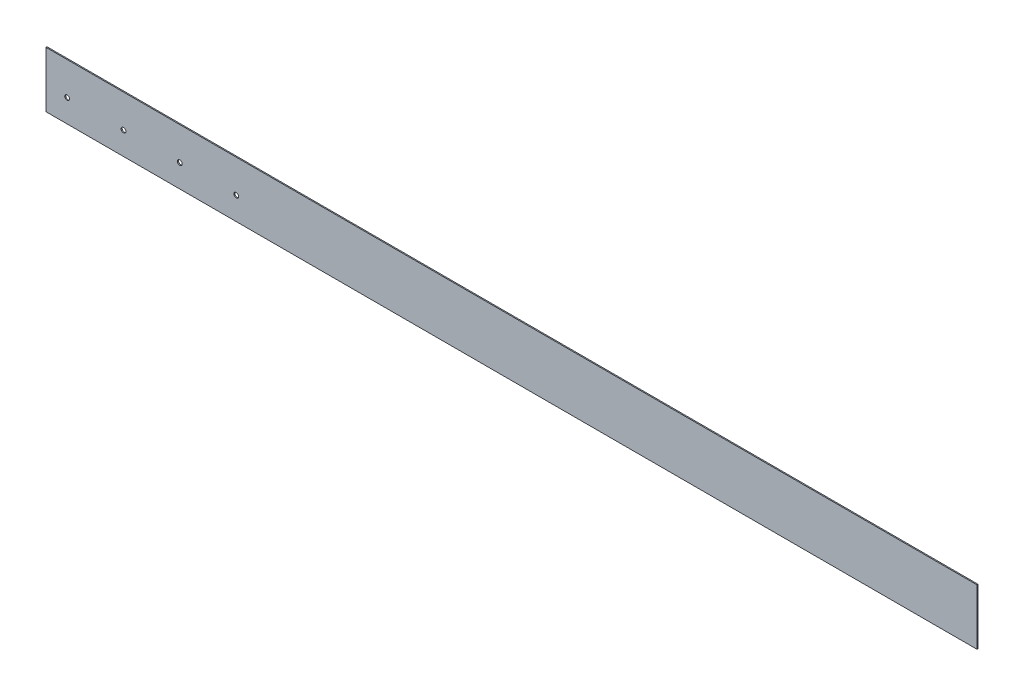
ISO-10303-21;
HEADER;
FILE_DESCRIPTION(('STEP AP214'),'2;1');
FILE_NAME('part.step','',(''),(''),'','','');
FILE_SCHEMA(('AUTOMOTIVE_DESIGN { 1 0 10303 214 1 1 1 1 }'));
ENDSEC;
DATA;
#1=APPLICATION_CONTEXT('core data for automotive mechanical design processes');
#2=APPLICATION_PROTOCOL_DEFINITION('international standard','automotive_design',2000,#1);
#3=PRODUCT_CONTEXT('',#1,'mechanical');
#4=PRODUCT('Part','Part','',(#3));
#5=PRODUCT_RELATED_PRODUCT_CATEGORY('part','',(#4));
#6=PRODUCT_DEFINITION_FORMATION('','',#4);
#7=PRODUCT_DEFINITION_CONTEXT('part definition',#1,'design');
#8=PRODUCT_DEFINITION('design','',#6,#7);
#9=PRODUCT_DEFINITION_SHAPE('','',#8);
#10=(LENGTH_UNIT() NAMED_UNIT(*) SI_UNIT(.MILLI.,.METRE.));
#11=(NAMED_UNIT(*) PLANE_ANGLE_UNIT() SI_UNIT($,.RADIAN.));
#12=(NAMED_UNIT(*) SI_UNIT($,.STERADIAN.) SOLID_ANGLE_UNIT());
#13=UNCERTAINTY_MEASURE_WITH_UNIT(LENGTH_MEASURE(1.E-05),#10,'distance_accuracy_value','');
#14=(GEOMETRIC_REPRESENTATION_CONTEXT(3) GLOBAL_UNCERTAINTY_ASSIGNED_CONTEXT((#13)) GLOBAL_UNIT_ASSIGNED_CONTEXT((#10,
#11,#12)) REPRESENTATION_CONTEXT('',''));
#15=CARTESIAN_POINT('',(0.,0.,0.));
#16=DIRECTION('',(0.,0.,1.));
#17=DIRECTION('',(1.,0.,0.));
#18=AXIS2_PLACEMENT_3D('',#15,#16,#17);
#19=CARTESIAN_POINT('',(0.,0.,10.));
#20=DIRECTION('',(1.,0.,0.));
#21=DIRECTION('',(0.,0.,-1.));
#22=AXIS2_PLACEMENT_3D('',#19,#20,#21);
#23=PLANE('',#22);
#24=DIRECTION('',(0.,-1.,0.));
#25=VECTOR('',#24,1.);
#26=CARTESIAN_POINT('',(0.,0.,0.));
#27=LINE('',#26,#25);
#28=CARTESIAN_POINT('',(0.,528.535100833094,0.));
#29=VERTEX_POINT('',#28);
#30=CARTESIAN_POINT('',(0.,0.,0.));
#31=VERTEX_POINT('',#30);
#32=EDGE_CURVE('E93',#29,#31,#27,.T.);
#33=ORIENTED_EDGE('',*,*,#32,.T.);
#34=DIRECTION('',(0.,0.,-1.));
#35=VECTOR('',#34,1.);
#36=CARTESIAN_POINT('',(0.,0.,10.));
#37=LINE('',#36,#35);
#38=CARTESIAN_POINT('',(0.,0.,10.));
#39=VERTEX_POINT('',#38);
#40=EDGE_CURVE('E11',#39,#31,#37,.T.);
#41=ORIENTED_EDGE('',*,*,#40,.F.);
#42=DIRECTION('',(0.,-1.,0.));
#43=VECTOR('',#42,1.);
#44=CARTESIAN_POINT('',(0.,0.,10.));
#45=LINE('',#44,#43);
#46=CARTESIAN_POINT('',(0.,528.535100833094,10.));
#47=VERTEX_POINT('',#46);
#48=EDGE_CURVE('E81',#47,#39,#45,.T.);
#49=ORIENTED_EDGE('',*,*,#48,.F.);
#50=DIRECTION('',(0.,0.,-1.));
#51=VECTOR('',#50,1.);
#52=CARTESIAN_POINT('',(0.,528.535100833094,10.));
#53=LINE('',#52,#51);
#54=EDGE_CURVE('E89',#47,#29,#53,.T.);
#55=ORIENTED_EDGE('',*,*,#54,.T.);
#56=EDGE_LOOP('',(#33,#41,#49,#55));
#57=FACE_BOUND('',#56,.T.);
#58=ADVANCED_FACE('F30',(#57),#23,.F.);
#59=CARTESIAN_POINT('',(0.,0.,10.));
#60=DIRECTION('',(0.,1.,0.));
#61=DIRECTION('',(0.,0.,1.));
#62=AXIS2_PLACEMENT_3D('',#59,#60,#61);
#63=PLANE('',#62);
#64=DIRECTION('',(1.,0.,0.));
#65=VECTOR('',#64,1.);
#66=CARTESIAN_POINT('',(0.,0.,0.));
#67=LINE('',#66,#65);
#68=CARTESIAN_POINT('',(8816.6546434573,0.,0.));
#69=VERTEX_POINT('',#68);
#70=EDGE_CURVE('E85',#31,#69,#67,.T.);
#71=ORIENTED_EDGE('',*,*,#70,.T.);
#72=DIRECTION('',(0.,0.,-1.));
#73=VECTOR('',#72,1.);
#74=CARTESIAN_POINT('',(8816.6546434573,0.,10.));
#75=LINE('',#74,#73);
#76=CARTESIAN_POINT('',(8816.6546434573,0.,10.));
#77=VERTEX_POINT('',#76);
#78=EDGE_CURVE('E38',#77,#69,#75,.T.);
#79=ORIENTED_EDGE('',*,*,#78,.F.);
#80=DIRECTION('',(1.,0.,0.));
#81=VECTOR('',#80,1.);
#82=CARTESIAN_POINT('',(0.,0.,10.));
#83=LINE('',#82,#81);
#84=EDGE_CURVE('E76',#39,#77,#83,.T.);
#85=ORIENTED_EDGE('',*,*,#84,.F.);
#86=ORIENTED_EDGE('',*,*,#40,.T.);
#87=EDGE_LOOP('',(#71,#79,#85,#86));
#88=FACE_BOUND('',#87,.T.);
#89=ADVANCED_FACE('F84',(#88),#63,.F.);
#90=CARTESIAN_POINT('',(8816.6546434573,0.,10.));
#91=DIRECTION('',(-1.,0.,0.));
#92=DIRECTION('',(0.,0.,1.));
#93=AXIS2_PLACEMENT_3D('',#90,#91,#92);
#94=PLANE('',#93);
#95=DIRECTION('',(0.,1.,0.));
#96=VECTOR('',#95,1.);
#97=CARTESIAN_POINT('',(8816.6546434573,0.,0.));
#98=LINE('',#97,#96);
#99=CARTESIAN_POINT('',(8816.6546434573,528.535100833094,0.));
#100=VERTEX_POINT('',#99);
#101=EDGE_CURVE('E63',#69,#100,#98,.T.);
#102=ORIENTED_EDGE('',*,*,#101,.T.);
#103=DIRECTION('',(0.,0.,-1.));
#104=VECTOR('',#103,1.);
#105=CARTESIAN_POINT('',(8816.6546434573,528.535100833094,10.));
#106=LINE('',#105,#104);
#107=CARTESIAN_POINT('',(8816.6546434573,528.535100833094,10.));
#108=VERTEX_POINT('',#107);
#109=EDGE_CURVE('E86',#108,#100,#106,.T.);
#110=ORIENTED_EDGE('',*,*,#109,.F.);
#111=DIRECTION('',(0.,1.,0.));
#112=VECTOR('',#111,1.);
#113=CARTESIAN_POINT('',(8816.6546434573,0.,10.));
#114=LINE('',#113,#112);
#115=EDGE_CURVE('E79',#77,#108,#114,.T.);
#116=ORIENTED_EDGE('',*,*,#115,.F.);
#117=ORIENTED_EDGE('',*,*,#78,.T.);
#118=EDGE_LOOP('',(#102,#110,#116,#117));
#119=FACE_BOUND('',#118,.T.);
#120=ADVANCED_FACE('F87',(#119),#94,.F.);
#121=CARTESIAN_POINT('',(0.,528.535100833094,10.));
#122=DIRECTION('',(0.,-1.,0.));
#123=DIRECTION('',(0.,0.,-1.));
#124=AXIS2_PLACEMENT_3D('',#121,#122,#123);
#125=PLANE('',#124);
#126=DIRECTION('',(-1.,0.,0.));
#127=VECTOR('',#126,1.);
#128=CARTESIAN_POINT('',(0.,528.535100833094,0.));
#129=LINE('',#128,#127);
#130=EDGE_CURVE('E69',#100,#29,#129,.T.);
#131=ORIENTED_EDGE('',*,*,#130,.T.);
#132=ORIENTED_EDGE('',*,*,#54,.F.);
#133=DIRECTION('',(-1.,0.,0.));
#134=VECTOR('',#133,1.);
#135=CARTESIAN_POINT('',(0.,528.535100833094,10.));
#136=LINE('',#135,#134);
#137=EDGE_CURVE('E46',#108,#47,#136,.T.);
#138=ORIENTED_EDGE('',*,*,#137,.F.);
#139=ORIENTED_EDGE('',*,*,#109,.T.);
#140=EDGE_LOOP('',(#131,#132,#138,#139));
#141=FACE_BOUND('',#140,.T.);
#142=ADVANCED_FACE('F101',(#141),#125,.F.);
#143=CARTESIAN_POINT('',(0.,528.535100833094,10.));
#144=DIRECTION('',(0.,0.,-1.));
#145=DIRECTION('',(-1.,0.,0.));
#146=AXIS2_PLACEMENT_3D('',#143,#144,#145);
#147=PLANE('',#146);
#148=CARTESIAN_POINT('',(1801.45218186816,216.299758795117,10.));
#149=DIRECTION('',(0.,0.,1.));
#150=DIRECTION('',(1.,0.,0.));
#151=AXIS2_PLACEMENT_3D('',#148,#149,#150);
#152=CIRCLE('',#151,22.5);
#153=CARTESIAN_POINT('',(1823.95218186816,216.299758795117,10.));
#154=VERTEX_POINT('',#153);
#155=EDGE_CURVE('E124',#154,#154,#152,.T.);
#156=ORIENTED_EDGE('',*,*,#155,.F.);
#157=EDGE_LOOP('',(#156));
#158=FACE_BOUND('',#157,.T.);
#159=CARTESIAN_POINT('',(1267.63478791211,216.299758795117,10.));
#160=DIRECTION('',(0.,0.,1.));
#161=DIRECTION('',(1.,0.,0.));
#162=AXIS2_PLACEMENT_3D('',#159,#160,#161);
#163=CIRCLE('',#162,22.5);
#164=CARTESIAN_POINT('',(1290.13478791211,216.299758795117,10.));
#165=VERTEX_POINT('',#164);
#166=EDGE_CURVE('E118',#165,#165,#163,.T.);
#167=ORIENTED_EDGE('',*,*,#166,.F.);
#168=EDGE_LOOP('',(#167));
#169=FACE_BOUND('',#168,.T.);
#170=CARTESIAN_POINT('',(733.817393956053,216.299758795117,10.));
#171=DIRECTION('',(0.,0.,1.));
#172=DIRECTION('',(1.,0.,0.));
#173=AXIS2_PLACEMENT_3D('',#170,#171,#172);
#174=CIRCLE('',#173,22.5);
#175=CARTESIAN_POINT('',(756.317393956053,216.299758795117,10.));
#176=VERTEX_POINT('',#175);
#177=EDGE_CURVE('E112',#176,#176,#174,.T.);
#178=ORIENTED_EDGE('',*,*,#177,.F.);
#179=EDGE_LOOP('',(#178));
#180=FACE_BOUND('',#179,.T.);
#181=CARTESIAN_POINT('',(200.,216.299758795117,10.));
#182=DIRECTION('',(0.,0.,1.));
#183=DIRECTION('',(1.,0.,0.));
#184=AXIS2_PLACEMENT_3D('',#181,#182,#183);
#185=CIRCLE('',#184,22.5);
#186=CARTESIAN_POINT('',(222.5,216.299758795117,10.));
#187=VERTEX_POINT('',#186);
#188=EDGE_CURVE('E109',#187,#187,#185,.T.);
#189=ORIENTED_EDGE('',*,*,#188,.F.);
#190=EDGE_LOOP('',(#189));
#191=FACE_BOUND('',#190,.T.);
#192=ORIENTED_EDGE('',*,*,#48,.T.);
#193=ORIENTED_EDGE('',*,*,#84,.T.);
#194=ORIENTED_EDGE('',*,*,#115,.T.);
#195=ORIENTED_EDGE('',*,*,#137,.T.);
#196=EDGE_LOOP('',(#192,#193,#194,#195));
#197=FACE_BOUND('',#196,.T.);
#198=ADVANCED_FACE('F77',(#158,#169,#180,#191,#197),#147,.F.);
#199=CARTESIAN_POINT('',(0.,528.535100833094,0.));
#200=DIRECTION('',(0.,0.,-1.));
#201=DIRECTION('',(-1.,0.,0.));
#202=AXIS2_PLACEMENT_3D('',#199,#200,#201);
#203=PLANE('',#202);
#204=CARTESIAN_POINT('',(1801.45218186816,216.299758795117,0.));
#205=DIRECTION('',(0.,0.,1.));
#206=DIRECTION('',(1.,0.,0.));
#207=AXIS2_PLACEMENT_3D('',#204,#205,#206);
#208=CIRCLE('',#207,22.5);
#209=CARTESIAN_POINT('',(1823.95218186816,216.299758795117,0.));
#210=VERTEX_POINT('',#209);
#211=EDGE_CURVE('E127',#210,#210,#208,.T.);
#212=ORIENTED_EDGE('',*,*,#211,.T.);
#213=EDGE_LOOP('',(#212));
#214=FACE_BOUND('',#213,.T.);
#215=CARTESIAN_POINT('',(1267.63478791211,216.299758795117,0.));
#216=DIRECTION('',(0.,0.,1.));
#217=DIRECTION('',(1.,0.,0.));
#218=AXIS2_PLACEMENT_3D('',#215,#216,#217);
#219=CIRCLE('',#218,22.5);
#220=CARTESIAN_POINT('',(1290.13478791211,216.299758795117,0.));
#221=VERTEX_POINT('',#220);
#222=EDGE_CURVE('E121',#221,#221,#219,.T.);
#223=ORIENTED_EDGE('',*,*,#222,.T.);
#224=EDGE_LOOP('',(#223));
#225=FACE_BOUND('',#224,.T.);
#226=CARTESIAN_POINT('',(733.817393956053,216.299758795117,0.));
#227=DIRECTION('',(0.,0.,1.));
#228=DIRECTION('',(1.,0.,0.));
#229=AXIS2_PLACEMENT_3D('',#226,#227,#228);
#230=CIRCLE('',#229,22.5);
#231=CARTESIAN_POINT('',(756.317393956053,216.299758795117,0.));
#232=VERTEX_POINT('',#231);
#233=EDGE_CURVE('E115',#232,#232,#230,.T.);
#234=ORIENTED_EDGE('',*,*,#233,.T.);
#235=EDGE_LOOP('',(#234));
#236=FACE_BOUND('',#235,.T.);
#237=CARTESIAN_POINT('',(200.,216.299758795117,0.));
#238=DIRECTION('',(0.,0.,1.));
#239=DIRECTION('',(1.,0.,0.));
#240=AXIS2_PLACEMENT_3D('',#237,#238,#239);
#241=CIRCLE('',#240,22.5);
#242=CARTESIAN_POINT('',(222.5,216.299758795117,0.));
#243=VERTEX_POINT('',#242);
#244=EDGE_CURVE('E96',#243,#243,#241,.T.);
#245=ORIENTED_EDGE('',*,*,#244,.T.);
#246=EDGE_LOOP('',(#245));
#247=FACE_BOUND('',#246,.T.);
#248=ORIENTED_EDGE('',*,*,#32,.F.);
#249=ORIENTED_EDGE('',*,*,#130,.F.);
#250=ORIENTED_EDGE('',*,*,#101,.F.);
#251=ORIENTED_EDGE('',*,*,#70,.F.);
#252=EDGE_LOOP('',(#248,#249,#250,#251));
#253=FACE_BOUND('',#252,.T.);
#254=ADVANCED_FACE('F104',(#214,#225,#236,#247,#253),#203,.T.);
#255=CARTESIAN_POINT('',(200.,216.299758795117,10.));
#256=DIRECTION('',(0.,0.,1.));
#257=DIRECTION('',(1.,0.,0.));
#258=AXIS2_PLACEMENT_3D('',#255,#256,#257);
#259=CYLINDRICAL_SURFACE('',#258,22.5);
#260=ORIENTED_EDGE('',*,*,#244,.F.);
#261=EDGE_LOOP('',(#260));
#262=FACE_BOUND('',#261,.T.);
#263=ORIENTED_EDGE('',*,*,#188,.T.);
#264=EDGE_LOOP('',(#263));
#265=FACE_BOUND('',#264,.T.);
#266=ADVANCED_FACE('F149',(#262,#265),#259,.F.);
#267=CARTESIAN_POINT('',(733.817393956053,216.299758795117,10.));
#268=DIRECTION('',(0.,0.,1.));
#269=DIRECTION('',(1.,0.,0.));
#270=AXIS2_PLACEMENT_3D('',#267,#268,#269);
#271=CYLINDRICAL_SURFACE('',#270,22.5);
#272=ORIENTED_EDGE('',*,*,#233,.F.);
#273=EDGE_LOOP('',(#272));
#274=FACE_BOUND('',#273,.T.);
#275=ORIENTED_EDGE('',*,*,#177,.T.);
#276=EDGE_LOOP('',(#275));
#277=FACE_BOUND('',#276,.T.);
#278=ADVANCED_FACE('F151',(#274,#277),#271,.F.);
#279=CARTESIAN_POINT('',(1267.63478791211,216.299758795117,10.));
#280=DIRECTION('',(0.,0.,1.));
#281=DIRECTION('',(1.,0.,0.));
#282=AXIS2_PLACEMENT_3D('',#279,#280,#281);
#283=CYLINDRICAL_SURFACE('',#282,22.5);
#284=ORIENTED_EDGE('',*,*,#222,.F.);
#285=EDGE_LOOP('',(#284));
#286=FACE_BOUND('',#285,.T.);
#287=ORIENTED_EDGE('',*,*,#166,.T.);
#288=EDGE_LOOP('',(#287));
#289=FACE_BOUND('',#288,.T.);
#290=ADVANCED_FACE('F136',(#286,#289),#283,.F.);
#291=CARTESIAN_POINT('',(1801.45218186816,216.299758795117,10.));
#292=DIRECTION('',(0.,0.,1.));
#293=DIRECTION('',(1.,0.,0.));
#294=AXIS2_PLACEMENT_3D('',#291,#292,#293);
#295=CYLINDRICAL_SURFACE('',#294,22.5);
#296=ORIENTED_EDGE('',*,*,#211,.F.);
#297=EDGE_LOOP('',(#296));
#298=FACE_BOUND('',#297,.T.);
#299=ORIENTED_EDGE('',*,*,#155,.T.);
#300=EDGE_LOOP('',(#299));
#301=FACE_BOUND('',#300,.T.);
#302=ADVANCED_FACE('F133',(#298,#301),#295,.F.);
#303=CLOSED_SHELL('',(#58,#89,#120,#142,#198,#254,#266,#278,#290,#302));
#304=MANIFOLD_SOLID_BREP('B2',#303);
#305=ADVANCED_BREP_SHAPE_REPRESENTATION('',(#18,#304),#14);
#306=SHAPE_DEFINITION_REPRESENTATION(#9,#305);
ENDSEC;
END-ISO-10303-21;
